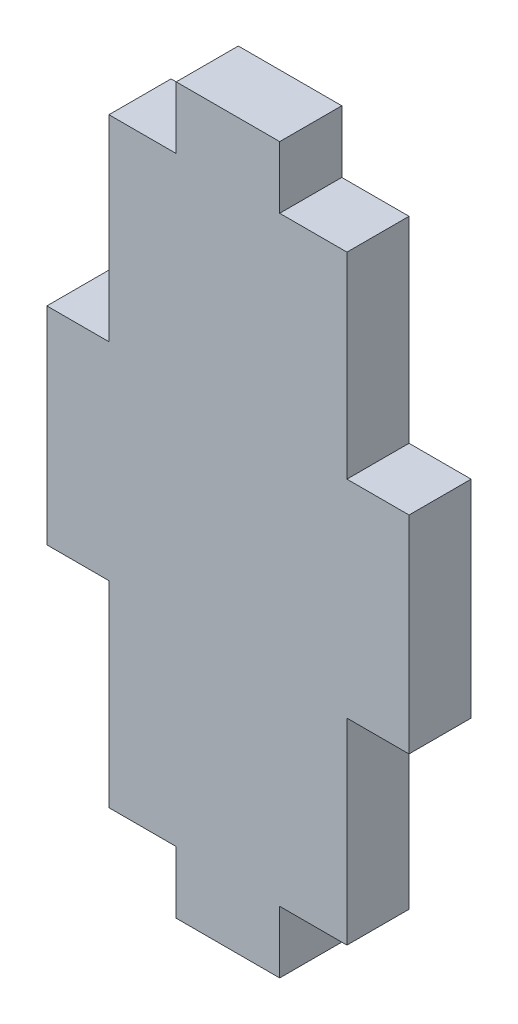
ISO-10303-21;
HEADER;
FILE_DESCRIPTION(('STEP AP214'),'2;1');
FILE_NAME('part.step','',(''),(''),'','','');
FILE_SCHEMA(('AUTOMOTIVE_DESIGN { 1 0 10303 214 1 1 1 1 }'));
ENDSEC;
DATA;
#1=APPLICATION_CONTEXT('core data for automotive mechanical design processes');
#2=APPLICATION_PROTOCOL_DEFINITION('international standard','automotive_design',2000,#1);
#3=PRODUCT_CONTEXT('',#1,'mechanical');
#4=PRODUCT('Part','Part','',(#3));
#5=PRODUCT_RELATED_PRODUCT_CATEGORY('part','',(#4));
#6=PRODUCT_DEFINITION_FORMATION('','',#4);
#7=PRODUCT_DEFINITION_CONTEXT('part definition',#1,'design');
#8=PRODUCT_DEFINITION('design','',#6,#7);
#9=PRODUCT_DEFINITION_SHAPE('','',#8);
#10=(LENGTH_UNIT() NAMED_UNIT(*) SI_UNIT(.MILLI.,.METRE.));
#11=(NAMED_UNIT(*) PLANE_ANGLE_UNIT() SI_UNIT($,.RADIAN.));
#12=(NAMED_UNIT(*) SI_UNIT($,.STERADIAN.) SOLID_ANGLE_UNIT());
#13=UNCERTAINTY_MEASURE_WITH_UNIT(LENGTH_MEASURE(1.E-05),#10,'distance_accuracy_value','');
#14=(GEOMETRIC_REPRESENTATION_CONTEXT(3) GLOBAL_UNCERTAINTY_ASSIGNED_CONTEXT((#13)) GLOBAL_UNIT_ASSIGNED_CONTEXT((#10,
#11,#12)) REPRESENTATION_CONTEXT('',''));
#15=CARTESIAN_POINT('',(0.,0.,0.));
#16=DIRECTION('',(0.,0.,1.));
#17=DIRECTION('',(1.,0.,0.));
#18=AXIS2_PLACEMENT_3D('',#15,#16,#17);
#19=CARTESIAN_POINT('',(62.6577284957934,36.4022221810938,3.));
#20=DIRECTION('',(-1.,0.,0.));
#21=DIRECTION('',(0.,0.,1.));
#22=AXIS2_PLACEMENT_3D('',#19,#20,#21);
#23=PLANE('',#22);
#24=DIRECTION('',(0.,1.,0.));
#25=VECTOR('',#24,1.);
#26=CARTESIAN_POINT('',(62.6577284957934,36.4022221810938,3.));
#27=LINE('',#26,#25);
#28=CARTESIAN_POINT('',(62.6577284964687,48.9022221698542,3.));
#29=VERTEX_POINT('',#28);
#30=CARTESIAN_POINT('',(62.6577284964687,58.9022221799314,3.));
#31=VERTEX_POINT('',#30);
#32=EDGE_CURVE('E282',#29,#31,#27,.T.);
#33=ORIENTED_EDGE('',*,*,#32,.F.);
#34=DIRECTION('',(0.,0.,-1.));
#35=VECTOR('',#34,1.);
#36=CARTESIAN_POINT('',(62.6577284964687,48.9022221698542,3.));
#37=LINE('',#36,#35);
#38=CARTESIAN_POINT('',(62.6577284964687,48.9022221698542,0.));
#39=VERTEX_POINT('',#38);
#40=EDGE_CURVE('E214',#29,#39,#37,.T.);
#41=ORIENTED_EDGE('',*,*,#40,.T.);
#42=DIRECTION('',(0.,1.,0.));
#43=VECTOR('',#42,1.);
#44=CARTESIAN_POINT('',(62.6577284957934,36.4022221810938,0.));
#45=LINE('',#44,#43);
#46=CARTESIAN_POINT('',(62.6577284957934,58.9022221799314,0.));
#47=VERTEX_POINT('',#46);
#48=EDGE_CURVE('E271',#39,#47,#45,.T.);
#49=ORIENTED_EDGE('',*,*,#48,.T.);
#50=DIRECTION('',(0.,0.,-1.));
#51=VECTOR('',#50,1.);
#52=CARTESIAN_POINT('',(62.6577284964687,58.9022221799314,3.));
#53=LINE('',#52,#51);
#54=EDGE_CURVE('E278',#31,#47,#53,.T.);
#55=ORIENTED_EDGE('',*,*,#54,.F.);
#56=EDGE_LOOP('',(#33,#41,#49,#55));
#57=FACE_BOUND('',#56,.T.);
#58=ADVANCED_FACE('F35',(#57),#23,.F.);
#59=CARTESIAN_POINT('',(45.1577284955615,71.4022221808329,3.));
#60=DIRECTION('',(0.,-1.,0.));
#61=DIRECTION('',(0.,0.,-1.));
#62=AXIS2_PLACEMENT_3D('',#59,#60,#61);
#63=PLANE('',#62);
#64=DIRECTION('',(-1.,0.,0.));
#65=VECTOR('',#64,1.);
#66=CARTESIAN_POINT('',(45.1577284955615,71.4022221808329,0.));
#67=LINE('',#66,#65);
#68=CARTESIAN_POINT('',(56.4077284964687,71.4022221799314,0.));
#69=VERTEX_POINT('',#68);
#70=CARTESIAN_POINT('',(51.4077284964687,71.4022221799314,0.));
#71=VERTEX_POINT('',#70);
#72=EDGE_CURVE('E297',#69,#71,#67,.T.);
#73=ORIENTED_EDGE('',*,*,#72,.T.);
#74=DIRECTION('',(0.,0.,-1.));
#75=VECTOR('',#74,1.);
#76=CARTESIAN_POINT('',(51.4077284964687,71.4022221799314,3.));
#77=LINE('',#76,#75);
#78=CARTESIAN_POINT('',(51.4077284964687,71.4022221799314,3.));
#79=VERTEX_POINT('',#78);
#80=EDGE_CURVE('E207',#79,#71,#77,.T.);
#81=ORIENTED_EDGE('',*,*,#80,.F.);
#82=DIRECTION('',(-1.,0.,0.));
#83=VECTOR('',#82,1.);
#84=CARTESIAN_POINT('',(45.1577284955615,71.4022221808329,3.));
#85=LINE('',#84,#83);
#86=CARTESIAN_POINT('',(56.4077284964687,71.4022221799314,3.));
#87=VERTEX_POINT('',#86);
#88=EDGE_CURVE('E285',#87,#79,#85,.T.);
#89=ORIENTED_EDGE('',*,*,#88,.F.);
#90=DIRECTION('',(0.,0.,-1.));
#91=VECTOR('',#90,1.);
#92=CARTESIAN_POINT('',(56.4077284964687,71.4022221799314,3.));
#93=LINE('',#92,#91);
#94=EDGE_CURVE('E267',#87,#69,#93,.T.);
#95=ORIENTED_EDGE('',*,*,#94,.T.);
#96=EDGE_LOOP('',(#73,#81,#89,#95));
#97=FACE_BOUND('',#96,.T.);
#98=ADVANCED_FACE('F383',(#97),#63,.F.);
#99=CARTESIAN_POINT('',(45.1577284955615,36.4022221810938,3.));
#100=DIRECTION('',(1.,0.,0.));
#101=DIRECTION('',(0.,0.,-1.));
#102=AXIS2_PLACEMENT_3D('',#99,#100,#101);
#103=PLANE('',#102);
#104=DIRECTION('',(0.,-1.,0.));
#105=VECTOR('',#104,1.);
#106=CARTESIAN_POINT('',(45.1577284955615,36.4022221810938,0.));
#107=LINE('',#106,#105);
#108=CARTESIAN_POINT('',(45.1577284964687,58.9022221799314,0.));
#109=VERTEX_POINT('',#108);
#110=CARTESIAN_POINT('',(45.1577284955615,48.9022221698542,0.));
#111=VERTEX_POINT('',#110);
#112=EDGE_CURVE('E300',#109,#111,#107,.T.);
#113=ORIENTED_EDGE('',*,*,#112,.T.);
#114=DIRECTION('',(0.,0.,-1.));
#115=VECTOR('',#114,1.);
#116=CARTESIAN_POINT('',(45.1577284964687,48.9022221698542,3.));
#117=LINE('',#116,#115);
#118=CARTESIAN_POINT('',(45.1577284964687,48.9022221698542,3.));
#119=VERTEX_POINT('',#118);
#120=EDGE_CURVE('E57',#119,#111,#117,.T.);
#121=ORIENTED_EDGE('',*,*,#120,.F.);
#122=DIRECTION('',(0.,-1.,0.));
#123=VECTOR('',#122,1.);
#124=CARTESIAN_POINT('',(45.1577284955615,36.4022221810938,3.));
#125=LINE('',#124,#123);
#126=CARTESIAN_POINT('',(45.1577284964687,58.9022221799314,3.));
#127=VERTEX_POINT('',#126);
#128=EDGE_CURVE('E289',#127,#119,#125,.T.);
#129=ORIENTED_EDGE('',*,*,#128,.F.);
#130=DIRECTION('',(0.,0.,-1.));
#131=VECTOR('',#130,1.);
#132=CARTESIAN_POINT('',(45.1577284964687,58.9022221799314,3.));
#133=LINE('',#132,#131);
#134=EDGE_CURVE('E177',#127,#109,#133,.T.);
#135=ORIENTED_EDGE('',*,*,#134,.T.);
#136=EDGE_LOOP('',(#113,#121,#129,#135));
#137=FACE_BOUND('',#136,.T.);
#138=ADVANCED_FACE('F372',(#137),#103,.F.);
#139=CARTESIAN_POINT('',(45.1577284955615,36.4022221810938,3.));
#140=DIRECTION('',(0.,1.,0.));
#141=DIRECTION('',(0.,0.,1.));
#142=AXIS2_PLACEMENT_3D('',#139,#140,#141);
#143=PLANE('',#142);
#144=DIRECTION('',(1.,0.,0.));
#145=VECTOR('',#144,1.);
#146=CARTESIAN_POINT('',(45.1577284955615,36.4022221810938,0.));
#147=LINE('',#146,#145);
#148=CARTESIAN_POINT('',(51.4077284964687,36.4022221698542,0.));
#149=VERTEX_POINT('',#148);
#150=CARTESIAN_POINT('',(56.4077284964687,36.4022221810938,0.));
#151=VERTEX_POINT('',#150);
#152=EDGE_CURVE('E286',#149,#151,#147,.T.);
#153=ORIENTED_EDGE('',*,*,#152,.T.);
#154=DIRECTION('',(0.,0.,-1.));
#155=VECTOR('',#154,1.);
#156=CARTESIAN_POINT('',(56.4077284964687,36.4022221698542,3.));
#157=LINE('',#156,#155);
#158=CARTESIAN_POINT('',(56.4077284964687,36.4022221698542,3.));
#159=VERTEX_POINT('',#158);
#160=EDGE_CURVE('E243',#159,#151,#157,.T.);
#161=ORIENTED_EDGE('',*,*,#160,.F.);
#162=DIRECTION('',(1.,0.,0.));
#163=VECTOR('',#162,1.);
#164=CARTESIAN_POINT('',(45.1577284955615,36.4022221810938,3.));
#165=LINE('',#164,#163);
#166=CARTESIAN_POINT('',(51.4077284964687,36.4022221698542,3.));
#167=VERTEX_POINT('',#166);
#168=EDGE_CURVE('E291',#167,#159,#165,.T.);
#169=ORIENTED_EDGE('',*,*,#168,.F.);
#170=DIRECTION('',(0.,0.,-1.));
#171=VECTOR('',#170,1.);
#172=CARTESIAN_POINT('',(51.4077284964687,36.4022221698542,3.));
#173=LINE('',#172,#171);
#174=EDGE_CURVE('E193',#167,#149,#173,.T.);
#175=ORIENTED_EDGE('',*,*,#174,.T.);
#176=EDGE_LOOP('',(#153,#161,#169,#175));
#177=FACE_BOUND('',#176,.T.);
#178=ADVANCED_FACE('F356',(#177),#143,.F.);
#179=CARTESIAN_POINT('',(0.,0.,3.));
#180=DIRECTION('',(0.,0.,-1.));
#181=DIRECTION('',(-1.,0.,0.));
#182=AXIS2_PLACEMENT_3D('',#179,#180,#181);
#183=PLANE('',#182);
#184=DIRECTION('',(0.,1.,0.));
#185=VECTOR('',#184,1.);
#186=CARTESIAN_POINT('',(59.6577284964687,48.9022221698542,3.));
#187=LINE('',#186,#185);
#188=CARTESIAN_POINT('',(59.6577284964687,39.4022221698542,3.));
#189=VERTEX_POINT('',#188);
#190=CARTESIAN_POINT('',(59.6577284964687,48.9022221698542,3.));
#191=VERTEX_POINT('',#190);
#192=EDGE_CURVE('E238',#189,#191,#187,.T.);
#193=ORIENTED_EDGE('',*,*,#192,.T.);
#194=DIRECTION('',(1.,0.,0.));
#195=VECTOR('',#194,1.);
#196=CARTESIAN_POINT('',(62.6577284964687,48.9022221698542,3.));
#197=LINE('',#196,#195);
#198=EDGE_CURVE('E240',#191,#29,#197,.T.);
#199=ORIENTED_EDGE('',*,*,#198,.T.);
#200=ORIENTED_EDGE('',*,*,#32,.T.);
#201=DIRECTION('',(-1.,0.,0.));
#202=VECTOR('',#201,1.);
#203=CARTESIAN_POINT('',(62.6577284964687,58.9022221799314,3.));
#204=LINE('',#203,#202);
#205=CARTESIAN_POINT('',(59.6577284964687,58.9022221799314,3.));
#206=VERTEX_POINT('',#205);
#207=EDGE_CURVE('E258',#31,#206,#204,.T.);
#208=ORIENTED_EDGE('',*,*,#207,.T.);
#209=DIRECTION('',(0.,1.,0.));
#210=VECTOR('',#209,1.);
#211=CARTESIAN_POINT('',(59.6577284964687,58.9022221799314,3.));
#212=LINE('',#211,#210);
#213=CARTESIAN_POINT('',(59.6577284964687,68.4022221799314,3.));
#214=VERTEX_POINT('',#213);
#215=EDGE_CURVE('E261',#206,#214,#212,.T.);
#216=ORIENTED_EDGE('',*,*,#215,.T.);
#217=DIRECTION('',(-1.,0.,0.));
#218=VECTOR('',#217,1.);
#219=CARTESIAN_POINT('',(59.6577284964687,68.4022221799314,3.));
#220=LINE('',#219,#218);
#221=CARTESIAN_POINT('',(56.4077284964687,68.4022221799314,3.));
#222=VERTEX_POINT('',#221);
#223=EDGE_CURVE('E264',#214,#222,#220,.T.);
#224=ORIENTED_EDGE('',*,*,#223,.T.);
#225=DIRECTION('',(0.,1.,0.));
#226=VECTOR('',#225,1.);
#227=CARTESIAN_POINT('',(56.4077284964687,68.4022221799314,3.));
#228=LINE('',#227,#226);
#229=EDGE_CURVE('E203',#222,#87,#228,.T.);
#230=ORIENTED_EDGE('',*,*,#229,.T.);
#231=ORIENTED_EDGE('',*,*,#88,.T.);
#232=DIRECTION('',(0.,-1.,0.));
#233=VECTOR('',#232,1.);
#234=CARTESIAN_POINT('',(51.4077284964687,71.4022221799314,3.));
#235=LINE('',#234,#233);
#236=CARTESIAN_POINT('',(51.4077284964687,68.4022221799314,3.));
#237=VERTEX_POINT('',#236);
#238=EDGE_CURVE('E187',#79,#237,#235,.T.);
#239=ORIENTED_EDGE('',*,*,#238,.T.);
#240=DIRECTION('',(-1.,0.,0.));
#241=VECTOR('',#240,1.);
#242=CARTESIAN_POINT('',(51.4077284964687,68.4022221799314,3.));
#243=LINE('',#242,#241);
#244=CARTESIAN_POINT('',(48.1577284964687,68.4022221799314,3.));
#245=VERTEX_POINT('',#244);
#246=EDGE_CURVE('E178',#237,#245,#243,.T.);
#247=ORIENTED_EDGE('',*,*,#246,.T.);
#248=DIRECTION('',(0.,-1.,0.));
#249=VECTOR('',#248,1.);
#250=CARTESIAN_POINT('',(48.1577284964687,68.4022221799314,3.));
#251=LINE('',#250,#249);
#252=CARTESIAN_POINT('',(48.1577284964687,58.9022221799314,3.));
#253=VERTEX_POINT('',#252);
#254=EDGE_CURVE('E172',#245,#253,#251,.T.);
#255=ORIENTED_EDGE('',*,*,#254,.T.);
#256=DIRECTION('',(-1.,0.,0.));
#257=VECTOR('',#256,1.);
#258=CARTESIAN_POINT('',(48.1577284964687,58.9022221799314,3.));
#259=LINE('',#258,#257);
#260=EDGE_CURVE('E181',#253,#127,#259,.T.);
#261=ORIENTED_EDGE('',*,*,#260,.T.);
#262=ORIENTED_EDGE('',*,*,#128,.T.);
#263=DIRECTION('',(1.,0.,0.));
#264=VECTOR('',#263,1.);
#265=CARTESIAN_POINT('',(48.1577284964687,48.9022221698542,3.));
#266=LINE('',#265,#264);
#267=CARTESIAN_POINT('',(48.1577284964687,48.9022221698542,3.));
#268=VERTEX_POINT('',#267);
#269=EDGE_CURVE('E210',#119,#268,#266,.T.);
#270=ORIENTED_EDGE('',*,*,#269,.T.);
#271=DIRECTION('',(0.,-1.,0.));
#272=VECTOR('',#271,1.);
#273=CARTESIAN_POINT('',(48.1577284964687,39.4022221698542,3.));
#274=LINE('',#273,#272);
#275=CARTESIAN_POINT('',(48.1577284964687,39.4022221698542,3.));
#276=VERTEX_POINT('',#275);
#277=EDGE_CURVE('E213',#268,#276,#274,.T.);
#278=ORIENTED_EDGE('',*,*,#277,.T.);
#279=DIRECTION('',(1.,0.,0.));
#280=VECTOR('',#279,1.);
#281=CARTESIAN_POINT('',(51.4077284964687,39.4022221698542,3.));
#282=LINE('',#281,#280);
#283=CARTESIAN_POINT('',(51.4077284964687,39.4022221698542,3.));
#284=VERTEX_POINT('',#283);
#285=EDGE_CURVE('E217',#276,#284,#282,.T.);
#286=ORIENTED_EDGE('',*,*,#285,.T.);
#287=DIRECTION('',(0.,-1.,0.));
#288=VECTOR('',#287,1.);
#289=CARTESIAN_POINT('',(51.4077284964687,36.4022221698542,3.));
#290=LINE('',#289,#288);
#291=EDGE_CURVE('E220',#284,#167,#290,.T.);
#292=ORIENTED_EDGE('',*,*,#291,.T.);
#293=ORIENTED_EDGE('',*,*,#168,.T.);
#294=DIRECTION('',(0.,1.,0.));
#295=VECTOR('',#294,1.);
#296=CARTESIAN_POINT('',(56.4077284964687,39.4022221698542,3.));
#297=LINE('',#296,#295);
#298=CARTESIAN_POINT('',(56.4077284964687,39.4022221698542,3.));
#299=VERTEX_POINT('',#298);
#300=EDGE_CURVE('E232',#159,#299,#297,.T.);
#301=ORIENTED_EDGE('',*,*,#300,.T.);
#302=DIRECTION('',(1.,0.,0.));
#303=VECTOR('',#302,1.);
#304=CARTESIAN_POINT('',(59.6577284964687,39.4022221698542,3.));
#305=LINE('',#304,#303);
#306=EDGE_CURVE('E235',#299,#189,#305,.T.);
#307=ORIENTED_EDGE('',*,*,#306,.T.);
#308=EDGE_LOOP('',(#193,#199,#200,#208,#216,#224,#230,#231,#239,#247,#255,#261,#262,#270,#278,
#286,#292,#293,#301,#307));
#309=FACE_BOUND('',#308,.T.);
#310=ADVANCED_FACE('F190',(#309),#183,.F.);
#311=CARTESIAN_POINT('',(0.,0.,0.));
#312=DIRECTION('',(0.,0.,-1.));
#313=DIRECTION('',(-1.,0.,0.));
#314=AXIS2_PLACEMENT_3D('',#311,#312,#313);
#315=PLANE('',#314);
#316=DIRECTION('',(1.,0.,0.));
#317=VECTOR('',#316,1.);
#318=CARTESIAN_POINT('',(0.,48.9022221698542,0.));
#319=LINE('',#318,#317);
#320=CARTESIAN_POINT('',(59.6577284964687,48.9022221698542,0.));
#321=VERTEX_POINT('',#320);
#322=EDGE_CURVE('E11',#321,#39,#319,.T.);
#323=ORIENTED_EDGE('',*,*,#322,.F.);
#324=DIRECTION('',(0.,1.,0.));
#325=VECTOR('',#324,1.);
#326=CARTESIAN_POINT('',(59.6577284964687,0.,0.));
#327=LINE('',#326,#325);
#328=CARTESIAN_POINT('',(59.6577284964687,39.4022221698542,0.));
#329=VERTEX_POINT('',#328);
#330=EDGE_CURVE('E42',#329,#321,#327,.T.);
#331=ORIENTED_EDGE('',*,*,#330,.F.);
#332=DIRECTION('',(1.,0.,0.));
#333=VECTOR('',#332,1.);
#334=CARTESIAN_POINT('',(0.,39.4022221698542,0.));
#335=LINE('',#334,#333);
#336=CARTESIAN_POINT('',(56.4077284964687,39.4022221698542,0.));
#337=VERTEX_POINT('',#336);
#338=EDGE_CURVE('E329',#337,#329,#335,.T.);
#339=ORIENTED_EDGE('',*,*,#338,.F.);
#340=DIRECTION('',(0.,1.,0.));
#341=VECTOR('',#340,1.);
#342=CARTESIAN_POINT('',(56.4077284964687,0.,0.));
#343=LINE('',#342,#341);
#344=EDGE_CURVE('E327',#151,#337,#343,.T.);
#345=ORIENTED_EDGE('',*,*,#344,.F.);
#346=ORIENTED_EDGE('',*,*,#152,.F.);
#347=DIRECTION('',(0.,-1.,0.));
#348=VECTOR('',#347,1.);
#349=CARTESIAN_POINT('',(51.4077284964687,0.,0.));
#350=LINE('',#349,#348);
#351=CARTESIAN_POINT('',(51.4077284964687,39.4022221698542,0.));
#352=VERTEX_POINT('',#351);
#353=EDGE_CURVE('E325',#352,#149,#350,.T.);
#354=ORIENTED_EDGE('',*,*,#353,.F.);
#355=DIRECTION('',(1.,0.,0.));
#356=VECTOR('',#355,1.);
#357=CARTESIAN_POINT('',(0.,39.4022221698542,0.));
#358=LINE('',#357,#356);
#359=CARTESIAN_POINT('',(48.1577284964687,39.4022221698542,0.));
#360=VERTEX_POINT('',#359);
#361=EDGE_CURVE('E323',#360,#352,#358,.T.);
#362=ORIENTED_EDGE('',*,*,#361,.F.);
#363=DIRECTION('',(0.,-1.,0.));
#364=VECTOR('',#363,1.);
#365=CARTESIAN_POINT('',(48.1577284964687,0.,0.));
#366=LINE('',#365,#364);
#367=CARTESIAN_POINT('',(48.1577284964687,48.9022221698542,0.));
#368=VERTEX_POINT('',#367);
#369=EDGE_CURVE('E321',#368,#360,#366,.T.);
#370=ORIENTED_EDGE('',*,*,#369,.F.);
#371=DIRECTION('',(1.,0.,0.));
#372=VECTOR('',#371,1.);
#373=CARTESIAN_POINT('',(0.,48.9022221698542,0.));
#374=LINE('',#373,#372);
#375=EDGE_CURVE('E319',#111,#368,#374,.T.);
#376=ORIENTED_EDGE('',*,*,#375,.F.);
#377=ORIENTED_EDGE('',*,*,#112,.F.);
#378=DIRECTION('',(-1.,0.,0.));
#379=VECTOR('',#378,1.);
#380=CARTESIAN_POINT('',(0.,58.9022221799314,0.));
#381=LINE('',#380,#379);
#382=CARTESIAN_POINT('',(48.1577284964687,58.9022221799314,0.));
#383=VERTEX_POINT('',#382);
#384=EDGE_CURVE('E312',#383,#109,#381,.T.);
#385=ORIENTED_EDGE('',*,*,#384,.F.);
#386=DIRECTION('',(0.,-1.,0.));
#387=VECTOR('',#386,1.);
#388=CARTESIAN_POINT('',(48.1577284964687,0.,0.));
#389=LINE('',#388,#387);
#390=CARTESIAN_POINT('',(48.1577284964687,68.4022221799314,0.));
#391=VERTEX_POINT('',#390);
#392=EDGE_CURVE('E175',#391,#383,#389,.T.);
#393=ORIENTED_EDGE('',*,*,#392,.F.);
#394=DIRECTION('',(-1.,0.,0.));
#395=VECTOR('',#394,1.);
#396=CARTESIAN_POINT('',(0.,68.4022221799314,0.));
#397=LINE('',#396,#395);
#398=CARTESIAN_POINT('',(51.4077284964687,68.4022221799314,0.));
#399=VERTEX_POINT('',#398);
#400=EDGE_CURVE('E315',#399,#391,#397,.T.);
#401=ORIENTED_EDGE('',*,*,#400,.F.);
#402=DIRECTION('',(0.,-1.,0.));
#403=VECTOR('',#402,1.);
#404=CARTESIAN_POINT('',(51.4077284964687,0.,0.));
#405=LINE('',#404,#403);
#406=EDGE_CURVE('E317',#71,#399,#405,.T.);
#407=ORIENTED_EDGE('',*,*,#406,.F.);
#408=ORIENTED_EDGE('',*,*,#72,.F.);
#409=DIRECTION('',(0.,1.,0.));
#410=VECTOR('',#409,1.);
#411=CARTESIAN_POINT('',(56.4077284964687,0.,0.));
#412=LINE('',#411,#410);
#413=CARTESIAN_POINT('',(56.4077284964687,68.4022221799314,0.));
#414=VERTEX_POINT('',#413);
#415=EDGE_CURVE('E310',#414,#69,#412,.T.);
#416=ORIENTED_EDGE('',*,*,#415,.F.);
#417=DIRECTION('',(-1.,0.,0.));
#418=VECTOR('',#417,1.);
#419=CARTESIAN_POINT('',(0.,68.4022221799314,0.));
#420=LINE('',#419,#418);
#421=CARTESIAN_POINT('',(59.6577284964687,68.4022221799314,0.));
#422=VERTEX_POINT('',#421);
#423=EDGE_CURVE('E308',#422,#414,#420,.T.);
#424=ORIENTED_EDGE('',*,*,#423,.F.);
#425=DIRECTION('',(0.,1.,0.));
#426=VECTOR('',#425,1.);
#427=CARTESIAN_POINT('',(59.6577284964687,0.,0.));
#428=LINE('',#427,#426);
#429=CARTESIAN_POINT('',(59.6577284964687,58.9022221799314,0.));
#430=VERTEX_POINT('',#429);
#431=EDGE_CURVE('E306',#430,#422,#428,.T.);
#432=ORIENTED_EDGE('',*,*,#431,.F.);
#433=DIRECTION('',(-1.,0.,0.));
#434=VECTOR('',#433,1.);
#435=CARTESIAN_POINT('',(0.,58.9022221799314,0.));
#436=LINE('',#435,#434);
#437=EDGE_CURVE('E294',#47,#430,#436,.T.);
#438=ORIENTED_EDGE('',*,*,#437,.F.);
#439=ORIENTED_EDGE('',*,*,#48,.F.);
#440=EDGE_LOOP('',(#323,#331,#339,#345,#346,#354,#362,#370,#376,#377,#385,#393,#401,#407,#408,
#416,#424,#432,#438,#439));
#441=FACE_BOUND('',#440,.T.);
#442=ADVANCED_FACE('F341',(#441),#315,.T.);
#443=CARTESIAN_POINT('',(56.4077284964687,68.4022221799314,3.));
#444=DIRECTION('',(-1.,0.,0.));
#445=DIRECTION('',(0.,0.,1.));
#446=AXIS2_PLACEMENT_3D('',#443,#444,#445);
#447=PLANE('',#446);
#448=ORIENTED_EDGE('',*,*,#415,.T.);
#449=ORIENTED_EDGE('',*,*,#94,.F.);
#450=ORIENTED_EDGE('',*,*,#229,.F.);
#451=DIRECTION('',(0.,0.,-1.));
#452=VECTOR('',#451,1.);
#453=CARTESIAN_POINT('',(56.4077284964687,68.4022221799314,3.));
#454=LINE('',#453,#452);
#455=EDGE_CURVE('E268',#222,#414,#454,.T.);
#456=ORIENTED_EDGE('',*,*,#455,.T.);
#457=EDGE_LOOP('',(#448,#449,#450,#456));
#458=FACE_BOUND('',#457,.T.);
#459=ADVANCED_FACE('F387',(#458),#447,.F.);
#460=CARTESIAN_POINT('',(59.6577284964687,68.4022221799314,3.));
#461=DIRECTION('',(0.,-1.,0.));
#462=DIRECTION('',(0.,0.,-1.));
#463=AXIS2_PLACEMENT_3D('',#460,#461,#462);
#464=PLANE('',#463);
#465=ORIENTED_EDGE('',*,*,#423,.T.);
#466=ORIENTED_EDGE('',*,*,#455,.F.);
#467=ORIENTED_EDGE('',*,*,#223,.F.);
#468=DIRECTION('',(0.,0.,-1.));
#469=VECTOR('',#468,1.);
#470=CARTESIAN_POINT('',(59.6577284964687,68.4022221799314,3.));
#471=LINE('',#470,#469);
#472=EDGE_CURVE('E272',#214,#422,#471,.T.);
#473=ORIENTED_EDGE('',*,*,#472,.T.);
#474=EDGE_LOOP('',(#465,#466,#467,#473));
#475=FACE_BOUND('',#474,.T.);
#476=ADVANCED_FACE('F391',(#475),#464,.F.);
#477=CARTESIAN_POINT('',(59.6577284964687,58.9022221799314,3.));
#478=DIRECTION('',(-1.,0.,0.));
#479=DIRECTION('',(0.,0.,1.));
#480=AXIS2_PLACEMENT_3D('',#477,#478,#479);
#481=PLANE('',#480);
#482=ORIENTED_EDGE('',*,*,#431,.T.);
#483=ORIENTED_EDGE('',*,*,#472,.F.);
#484=ORIENTED_EDGE('',*,*,#215,.F.);
#485=DIRECTION('',(0.,0.,-1.));
#486=VECTOR('',#485,1.);
#487=CARTESIAN_POINT('',(59.6577284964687,58.9022221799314,3.));
#488=LINE('',#487,#486);
#489=EDGE_CURVE('E275',#206,#430,#488,.T.);
#490=ORIENTED_EDGE('',*,*,#489,.T.);
#491=EDGE_LOOP('',(#482,#483,#484,#490));
#492=FACE_BOUND('',#491,.T.);
#493=ADVANCED_FACE('F394',(#492),#481,.F.);
#494=CARTESIAN_POINT('',(62.6577284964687,58.9022221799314,3.));
#495=DIRECTION('',(0.,-1.,0.));
#496=DIRECTION('',(0.,0.,-1.));
#497=AXIS2_PLACEMENT_3D('',#494,#495,#496);
#498=PLANE('',#497);
#499=ORIENTED_EDGE('',*,*,#437,.T.);
#500=ORIENTED_EDGE('',*,*,#489,.F.);
#501=ORIENTED_EDGE('',*,*,#207,.F.);
#502=ORIENTED_EDGE('',*,*,#54,.T.);
#503=EDGE_LOOP('',(#499,#500,#501,#502));
#504=FACE_BOUND('',#503,.T.);
#505=ADVANCED_FACE('F396',(#504),#498,.F.);
#506=CARTESIAN_POINT('',(48.1577284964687,68.4022221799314,3.));
#507=DIRECTION('',(1.,0.,0.));
#508=DIRECTION('',(0.,0.,-1.));
#509=AXIS2_PLACEMENT_3D('',#506,#507,#508);
#510=PLANE('',#509);
#511=ORIENTED_EDGE('',*,*,#392,.T.);
#512=DIRECTION('',(0.,0.,-1.));
#513=VECTOR('',#512,1.);
#514=CARTESIAN_POINT('',(48.1577284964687,58.9022221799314,3.));
#515=LINE('',#514,#513);
#516=EDGE_CURVE('E49',#253,#383,#515,.T.);
#517=ORIENTED_EDGE('',*,*,#516,.F.);
#518=ORIENTED_EDGE('',*,*,#254,.F.);
#519=DIRECTION('',(0.,0.,-1.));
#520=VECTOR('',#519,1.);
#521=CARTESIAN_POINT('',(48.1577284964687,68.4022221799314,3.));
#522=LINE('',#521,#520);
#523=EDGE_CURVE('E201',#245,#391,#522,.T.);
#524=ORIENTED_EDGE('',*,*,#523,.T.);
#525=EDGE_LOOP('',(#511,#517,#518,#524));
#526=FACE_BOUND('',#525,.T.);
#527=ADVANCED_FACE('F169',(#526),#510,.F.);
#528=CARTESIAN_POINT('',(51.4077284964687,68.4022221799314,3.));
#529=DIRECTION('',(0.,-1.,0.));
#530=DIRECTION('',(0.,0.,-1.));
#531=AXIS2_PLACEMENT_3D('',#528,#529,#530);
#532=PLANE('',#531);
#533=ORIENTED_EDGE('',*,*,#400,.T.);
#534=ORIENTED_EDGE('',*,*,#523,.F.);
#535=ORIENTED_EDGE('',*,*,#246,.F.);
#536=DIRECTION('',(0.,0.,-1.));
#537=VECTOR('',#536,1.);
#538=CARTESIAN_POINT('',(51.4077284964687,68.4022221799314,3.));
#539=LINE('',#538,#537);
#540=EDGE_CURVE('E204',#237,#399,#539,.T.);
#541=ORIENTED_EDGE('',*,*,#540,.T.);
#542=EDGE_LOOP('',(#533,#534,#535,#541));
#543=FACE_BOUND('',#542,.T.);
#544=ADVANCED_FACE('F377',(#543),#532,.F.);
#545=CARTESIAN_POINT('',(51.4077284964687,71.4022221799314,3.));
#546=DIRECTION('',(1.,0.,0.));
#547=DIRECTION('',(0.,0.,-1.));
#548=AXIS2_PLACEMENT_3D('',#545,#546,#547);
#549=PLANE('',#548);
#550=ORIENTED_EDGE('',*,*,#406,.T.);
#551=ORIENTED_EDGE('',*,*,#540,.F.);
#552=ORIENTED_EDGE('',*,*,#238,.F.);
#553=ORIENTED_EDGE('',*,*,#80,.T.);
#554=EDGE_LOOP('',(#550,#551,#552,#553));
#555=FACE_BOUND('',#554,.T.);
#556=ADVANCED_FACE('F379',(#555),#549,.F.);
#557=CARTESIAN_POINT('',(48.1577284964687,58.9022221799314,3.));
#558=DIRECTION('',(0.,-1.,0.));
#559=DIRECTION('',(0.,0.,-1.));
#560=AXIS2_PLACEMENT_3D('',#557,#558,#559);
#561=PLANE('',#560);
#562=ORIENTED_EDGE('',*,*,#384,.T.);
#563=ORIENTED_EDGE('',*,*,#134,.F.);
#564=ORIENTED_EDGE('',*,*,#260,.F.);
#565=ORIENTED_EDGE('',*,*,#516,.T.);
#566=EDGE_LOOP('',(#562,#563,#564,#565));
#567=FACE_BOUND('',#566,.T.);
#568=ADVANCED_FACE('F182',(#567),#561,.F.);
#569=CARTESIAN_POINT('',(51.4077284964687,36.4022221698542,3.));
#570=DIRECTION('',(1.,0.,0.));
#571=DIRECTION('',(0.,0.,-1.));
#572=AXIS2_PLACEMENT_3D('',#569,#570,#571);
#573=PLANE('',#572);
#574=ORIENTED_EDGE('',*,*,#353,.T.);
#575=ORIENTED_EDGE('',*,*,#174,.F.);
#576=ORIENTED_EDGE('',*,*,#291,.F.);
#577=DIRECTION('',(0.,0.,-1.));
#578=VECTOR('',#577,1.);
#579=CARTESIAN_POINT('',(51.4077284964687,39.4022221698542,3.));
#580=LINE('',#579,#578);
#581=EDGE_CURVE('E196',#284,#352,#580,.T.);
#582=ORIENTED_EDGE('',*,*,#581,.T.);
#583=EDGE_LOOP('',(#574,#575,#576,#582));
#584=FACE_BOUND('',#583,.T.);
#585=ADVANCED_FACE('F360',(#584),#573,.F.);
#586=CARTESIAN_POINT('',(51.4077284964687,39.4022221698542,3.));
#587=DIRECTION('',(0.,1.,0.));
#588=DIRECTION('',(0.,0.,1.));
#589=AXIS2_PLACEMENT_3D('',#586,#587,#588);
#590=PLANE('',#589);
#591=ORIENTED_EDGE('',*,*,#361,.T.);
#592=ORIENTED_EDGE('',*,*,#581,.F.);
#593=ORIENTED_EDGE('',*,*,#285,.F.);
#594=DIRECTION('',(0.,0.,-1.));
#595=VECTOR('',#594,1.);
#596=CARTESIAN_POINT('',(48.1577284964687,39.4022221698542,3.));
#597=LINE('',#596,#595);
#598=EDGE_CURVE('E225',#276,#360,#597,.T.);
#599=ORIENTED_EDGE('',*,*,#598,.T.);
#600=EDGE_LOOP('',(#591,#592,#593,#599));
#601=FACE_BOUND('',#600,.T.);
#602=ADVANCED_FACE('F364',(#601),#590,.F.);
#603=CARTESIAN_POINT('',(48.1577284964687,39.4022221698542,3.));
#604=DIRECTION('',(1.,0.,0.));
#605=DIRECTION('',(0.,0.,-1.));
#606=AXIS2_PLACEMENT_3D('',#603,#604,#605);
#607=PLANE('',#606);
#608=ORIENTED_EDGE('',*,*,#369,.T.);
#609=ORIENTED_EDGE('',*,*,#598,.F.);
#610=ORIENTED_EDGE('',*,*,#277,.F.);
#611=DIRECTION('',(0.,0.,-1.));
#612=VECTOR('',#611,1.);
#613=CARTESIAN_POINT('',(48.1577284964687,48.9022221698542,3.));
#614=LINE('',#613,#612);
#615=EDGE_CURVE('E228',#268,#368,#614,.T.);
#616=ORIENTED_EDGE('',*,*,#615,.T.);
#617=EDGE_LOOP('',(#608,#609,#610,#616));
#618=FACE_BOUND('',#617,.T.);
#619=ADVANCED_FACE('F369',(#618),#607,.F.);
#620=CARTESIAN_POINT('',(48.1577284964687,48.9022221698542,3.));
#621=DIRECTION('',(0.,1.,0.));
#622=DIRECTION('',(0.,0.,1.));
#623=AXIS2_PLACEMENT_3D('',#620,#621,#622);
#624=PLANE('',#623);
#625=ORIENTED_EDGE('',*,*,#375,.T.);
#626=ORIENTED_EDGE('',*,*,#615,.F.);
#627=ORIENTED_EDGE('',*,*,#269,.F.);
#628=ORIENTED_EDGE('',*,*,#120,.T.);
#629=EDGE_LOOP('',(#625,#626,#627,#628));
#630=FACE_BOUND('',#629,.T.);
#631=ADVANCED_FACE('F370',(#630),#624,.F.);
#632=CARTESIAN_POINT('',(62.6577284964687,48.9022221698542,3.));
#633=DIRECTION('',(0.,1.,0.));
#634=DIRECTION('',(0.,0.,1.));
#635=AXIS2_PLACEMENT_3D('',#632,#633,#634);
#636=PLANE('',#635);
#637=ORIENTED_EDGE('',*,*,#322,.T.);
#638=ORIENTED_EDGE('',*,*,#40,.F.);
#639=ORIENTED_EDGE('',*,*,#198,.F.);
#640=DIRECTION('',(0.,0.,-1.));
#641=VECTOR('',#640,1.);
#642=CARTESIAN_POINT('',(59.6577284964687,48.9022221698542,3.));
#643=LINE('',#642,#641);
#644=EDGE_CURVE('E246',#191,#321,#643,.T.);
#645=ORIENTED_EDGE('',*,*,#644,.T.);
#646=EDGE_LOOP('',(#637,#638,#639,#645));
#647=FACE_BOUND('',#646,.T.);
#648=ADVANCED_FACE('F339',(#647),#636,.F.);
#649=CARTESIAN_POINT('',(59.6577284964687,48.9022221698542,3.));
#650=DIRECTION('',(-1.,0.,0.));
#651=DIRECTION('',(0.,0.,1.));
#652=AXIS2_PLACEMENT_3D('',#649,#650,#651);
#653=PLANE('',#652);
#654=ORIENTED_EDGE('',*,*,#330,.T.);
#655=ORIENTED_EDGE('',*,*,#644,.F.);
#656=ORIENTED_EDGE('',*,*,#192,.F.);
#657=DIRECTION('',(0.,0.,-1.));
#658=VECTOR('',#657,1.);
#659=CARTESIAN_POINT('',(59.6577284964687,39.4022221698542,3.));
#660=LINE('',#659,#658);
#661=EDGE_CURVE('E249',#189,#329,#660,.T.);
#662=ORIENTED_EDGE('',*,*,#661,.T.);
#663=EDGE_LOOP('',(#654,#655,#656,#662));
#664=FACE_BOUND('',#663,.T.);
#665=ADVANCED_FACE('F332',(#664),#653,.F.);
#666=CARTESIAN_POINT('',(59.6577284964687,39.4022221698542,3.));
#667=DIRECTION('',(0.,1.,0.));
#668=DIRECTION('',(0.,0.,1.));
#669=AXIS2_PLACEMENT_3D('',#666,#667,#668);
#670=PLANE('',#669);
#671=ORIENTED_EDGE('',*,*,#338,.T.);
#672=ORIENTED_EDGE('',*,*,#661,.F.);
#673=ORIENTED_EDGE('',*,*,#306,.F.);
#674=DIRECTION('',(0.,0.,-1.));
#675=VECTOR('',#674,1.);
#676=CARTESIAN_POINT('',(56.4077284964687,39.4022221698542,3.));
#677=LINE('',#676,#675);
#678=EDGE_CURVE('E252',#299,#337,#677,.T.);
#679=ORIENTED_EDGE('',*,*,#678,.T.);
#680=EDGE_LOOP('',(#671,#672,#673,#679));
#681=FACE_BOUND('',#680,.T.);
#682=ADVANCED_FACE('F349',(#681),#670,.F.);
#683=CARTESIAN_POINT('',(56.4077284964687,39.4022221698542,3.));
#684=DIRECTION('',(-1.,0.,0.));
#685=DIRECTION('',(0.,0.,1.));
#686=AXIS2_PLACEMENT_3D('',#683,#684,#685);
#687=PLANE('',#686);
#688=ORIENTED_EDGE('',*,*,#344,.T.);
#689=ORIENTED_EDGE('',*,*,#678,.F.);
#690=ORIENTED_EDGE('',*,*,#300,.F.);
#691=ORIENTED_EDGE('',*,*,#160,.T.);
#692=EDGE_LOOP('',(#688,#689,#690,#691));
#693=FACE_BOUND('',#692,.T.);
#694=ADVANCED_FACE('F428',(#693),#687,.F.);
#695=CLOSED_SHELL('',(#58,#98,#138,#178,#310,#442,#459,#476,#493,#505,#527,#544,#556,#568,#585,
#602,#619,#631,#648,#665,#682,#694));
#696=MANIFOLD_SOLID_BREP('B2',#695);
#697=ADVANCED_BREP_SHAPE_REPRESENTATION('',(#18,#696),#14);
#698=SHAPE_DEFINITION_REPRESENTATION(#9,#697);
ENDSEC;
END-ISO-10303-21;
